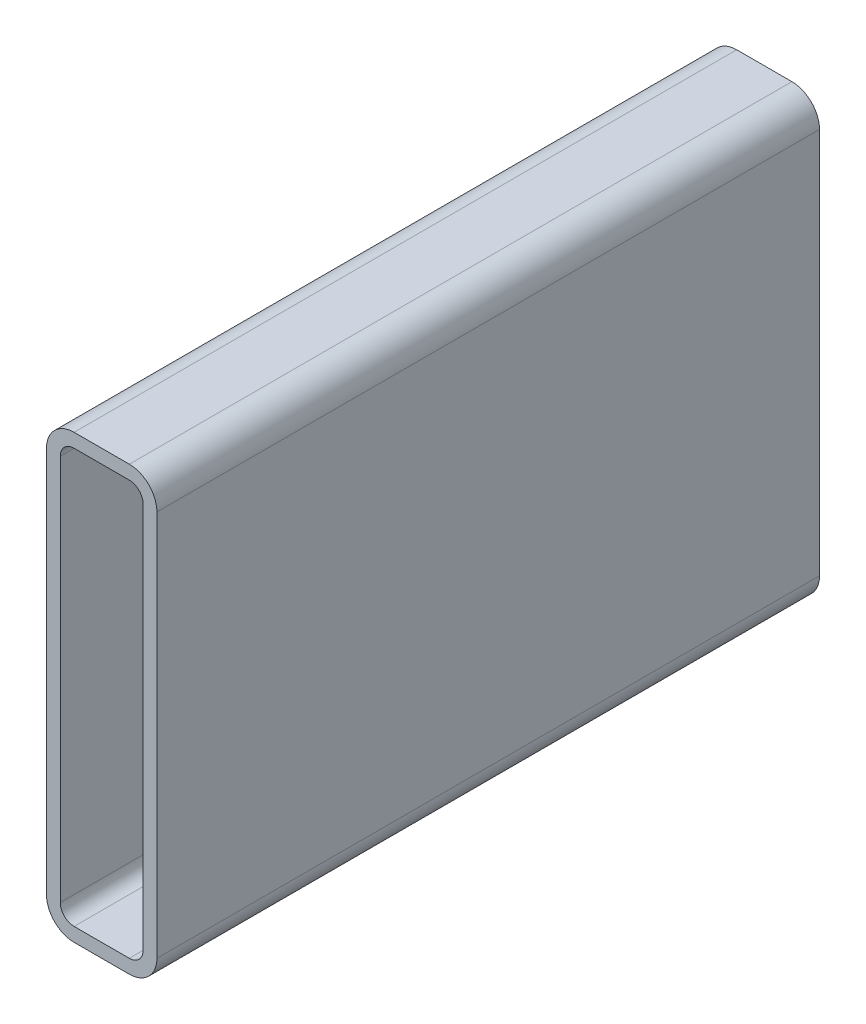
ISO-10303-21;
HEADER;
FILE_DESCRIPTION(('STEP AP214'),'2;1');
FILE_NAME('part.step','',(''),(''),'','','');
FILE_SCHEMA(('AUTOMOTIVE_DESIGN { 1 0 10303 214 1 1 1 1 }'));
ENDSEC;
DATA;
#1=APPLICATION_CONTEXT('core data for automotive mechanical design processes');
#2=APPLICATION_PROTOCOL_DEFINITION('international standard','automotive_design',2000,#1);
#3=PRODUCT_CONTEXT('',#1,'mechanical');
#4=PRODUCT('Part','Part','',(#3));
#5=PRODUCT_RELATED_PRODUCT_CATEGORY('part','',(#4));
#6=PRODUCT_DEFINITION_FORMATION('','',#4);
#7=PRODUCT_DEFINITION_CONTEXT('part definition',#1,'design');
#8=PRODUCT_DEFINITION('design','',#6,#7);
#9=PRODUCT_DEFINITION_SHAPE('','',#8);
#10=(LENGTH_UNIT() NAMED_UNIT(*) SI_UNIT(.MILLI.,.METRE.));
#11=(NAMED_UNIT(*) PLANE_ANGLE_UNIT() SI_UNIT($,.RADIAN.));
#12=(NAMED_UNIT(*) SI_UNIT($,.STERADIAN.) SOLID_ANGLE_UNIT());
#13=UNCERTAINTY_MEASURE_WITH_UNIT(LENGTH_MEASURE(1.E-05),#10,'distance_accuracy_value','');
#14=(GEOMETRIC_REPRESENTATION_CONTEXT(3) GLOBAL_UNCERTAINTY_ASSIGNED_CONTEXT((#13)) GLOBAL_UNIT_ASSIGNED_CONTEXT((#10,
#11,#12)) REPRESENTATION_CONTEXT('',''));
#15=CARTESIAN_POINT('',(0.,0.,0.));
#16=DIRECTION('',(0.,0.,1.));
#17=DIRECTION('',(1.,0.,0.));
#18=AXIS2_PLACEMENT_3D('',#15,#16,#17);
#19=CARTESIAN_POINT('',(12.7,190.5,304.8));
#20=DIRECTION('',(0.,0.,1.));
#21=DIRECTION('',(1.,0.,0.));
#22=AXIS2_PLACEMENT_3D('',#19,#20,#21);
#23=PLANE('',#22);
#24=CARTESIAN_POINT('',(12.7,190.5,304.8));
#25=DIRECTION('',(0.,0.,1.));
#26=DIRECTION('',(1.,0.,0.));
#27=AXIS2_PLACEMENT_3D('',#24,#25,#26);
#28=CIRCLE('',#27,12.7);
#29=CARTESIAN_POINT('',(12.7,203.2,304.8));
#30=VERTEX_POINT('',#29);
#31=CARTESIAN_POINT('',(0.,190.5,304.8));
#32=VERTEX_POINT('',#31);
#33=EDGE_CURVE('E211',#30,#32,#28,.T.);
#34=ORIENTED_EDGE('',*,*,#33,.T.);
#35=DIRECTION('',(0.,-1.,0.));
#36=VECTOR('',#35,1.);
#37=CARTESIAN_POINT('',(0.,12.7,304.8));
#38=LINE('',#37,#36);
#39=CARTESIAN_POINT('',(0.,12.7,304.8));
#40=VERTEX_POINT('',#39);
#41=EDGE_CURVE('E214',#32,#40,#38,.T.);
#42=ORIENTED_EDGE('',*,*,#41,.T.);
#43=CARTESIAN_POINT('',(12.7,12.7,304.8));
#44=DIRECTION('',(0.,0.,1.));
#45=DIRECTION('',(1.,0.,0.));
#46=AXIS2_PLACEMENT_3D('',#43,#44,#45);
#47=CIRCLE('',#46,12.7);
#48=CARTESIAN_POINT('',(12.7,0.,304.8));
#49=VERTEX_POINT('',#48);
#50=EDGE_CURVE('E217',#40,#49,#47,.T.);
#51=ORIENTED_EDGE('',*,*,#50,.T.);
#52=DIRECTION('',(1.,0.,0.));
#53=VECTOR('',#52,1.);
#54=CARTESIAN_POINT('',(38.1,0.,304.8));
#55=LINE('',#54,#53);
#56=CARTESIAN_POINT('',(38.1,0.,304.8));
#57=VERTEX_POINT('',#56);
#58=EDGE_CURVE('E219',#49,#57,#55,.T.);
#59=ORIENTED_EDGE('',*,*,#58,.T.);
#60=CARTESIAN_POINT('',(38.1,12.7,304.8));
#61=DIRECTION('',(0.,0.,1.));
#62=DIRECTION('',(1.,0.,0.));
#63=AXIS2_PLACEMENT_3D('',#60,#61,#62);
#64=CIRCLE('',#63,12.7);
#65=CARTESIAN_POINT('',(50.8,12.7,304.8));
#66=VERTEX_POINT('',#65);
#67=EDGE_CURVE('E221',#57,#66,#64,.T.);
#68=ORIENTED_EDGE('',*,*,#67,.T.);
#69=DIRECTION('',(0.,1.,0.));
#70=VECTOR('',#69,1.);
#71=CARTESIAN_POINT('',(50.8,190.5,304.8));
#72=LINE('',#71,#70);
#73=CARTESIAN_POINT('',(50.8,190.5,304.8));
#74=VERTEX_POINT('',#73);
#75=EDGE_CURVE('E223',#66,#74,#72,.T.);
#76=ORIENTED_EDGE('',*,*,#75,.T.);
#77=CARTESIAN_POINT('',(38.1,190.5,304.8));
#78=DIRECTION('',(0.,0.,1.));
#79=DIRECTION('',(1.,0.,0.));
#80=AXIS2_PLACEMENT_3D('',#77,#78,#79);
#81=CIRCLE('',#80,12.7);
#82=CARTESIAN_POINT('',(38.1,203.2,304.8));
#83=VERTEX_POINT('',#82);
#84=EDGE_CURVE('E225',#74,#83,#81,.T.);
#85=ORIENTED_EDGE('',*,*,#84,.T.);
#86=DIRECTION('',(-1.,0.,0.));
#87=VECTOR('',#86,1.);
#88=CARTESIAN_POINT('',(12.7,203.2,304.8));
#89=LINE('',#88,#87);
#90=EDGE_CURVE('E227',#83,#30,#89,.T.);
#91=ORIENTED_EDGE('',*,*,#90,.T.);
#92=EDGE_LOOP('',(#34,#42,#51,#59,#68,#76,#85,#91));
#93=FACE_BOUND('',#92,.T.);
#94=DIRECTION('',(0.,-1.,0.));
#95=VECTOR('',#94,1.);
#96=CARTESIAN_POINT('',(6.35,12.7,304.8));
#97=LINE('',#96,#95);
#98=CARTESIAN_POINT('',(6.35,190.5,304.8));
#99=VERTEX_POINT('',#98);
#100=CARTESIAN_POINT('',(6.35,12.7,304.8));
#101=VERTEX_POINT('',#100);
#102=EDGE_CURVE('E154',#99,#101,#97,.T.);
#103=ORIENTED_EDGE('',*,*,#102,.F.);
#104=CARTESIAN_POINT('',(12.7,190.5,304.8));
#105=DIRECTION('',(0.,0.,1.));
#106=DIRECTION('',(1.,0.,0.));
#107=AXIS2_PLACEMENT_3D('',#104,#105,#106);
#108=CIRCLE('',#107,6.35000000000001);
#109=CARTESIAN_POINT('',(12.7,196.85,304.8));
#110=VERTEX_POINT('',#109);
#111=EDGE_CURVE('E146',#110,#99,#108,.T.);
#112=ORIENTED_EDGE('',*,*,#111,.F.);
#113=DIRECTION('',(-1.,0.,0.));
#114=VECTOR('',#113,1.);
#115=CARTESIAN_POINT('',(12.7,196.85,304.8));
#116=LINE('',#115,#114);
#117=CARTESIAN_POINT('',(38.1,196.85,304.8));
#118=VERTEX_POINT('',#117);
#119=EDGE_CURVE('E179',#118,#110,#116,.T.);
#120=ORIENTED_EDGE('',*,*,#119,.F.);
#121=CARTESIAN_POINT('',(38.1,190.5,304.8));
#122=DIRECTION('',(0.,0.,1.));
#123=DIRECTION('',(1.,0.,0.));
#124=AXIS2_PLACEMENT_3D('',#121,#122,#123);
#125=CIRCLE('',#124,6.35000000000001);
#126=CARTESIAN_POINT('',(44.45,190.5,304.8));
#127=VERTEX_POINT('',#126);
#128=EDGE_CURVE('E177',#127,#118,#125,.T.);
#129=ORIENTED_EDGE('',*,*,#128,.F.);
#130=DIRECTION('',(0.,1.,0.));
#131=VECTOR('',#130,1.);
#132=CARTESIAN_POINT('',(44.45,190.5,304.8));
#133=LINE('',#132,#131);
#134=CARTESIAN_POINT('',(44.45,12.7,304.8));
#135=VERTEX_POINT('',#134);
#136=EDGE_CURVE('E175',#135,#127,#133,.T.);
#137=ORIENTED_EDGE('',*,*,#136,.F.);
#138=CARTESIAN_POINT('',(38.1,12.7,304.8));
#139=DIRECTION('',(0.,0.,1.));
#140=DIRECTION('',(1.,0.,0.));
#141=AXIS2_PLACEMENT_3D('',#138,#139,#140);
#142=CIRCLE('',#141,6.35);
#143=CARTESIAN_POINT('',(38.1,6.35,304.8));
#144=VERTEX_POINT('',#143);
#145=EDGE_CURVE('E173',#144,#135,#142,.T.);
#146=ORIENTED_EDGE('',*,*,#145,.F.);
#147=DIRECTION('',(1.,0.,0.));
#148=VECTOR('',#147,1.);
#149=CARTESIAN_POINT('',(38.1,6.35,304.8));
#150=LINE('',#149,#148);
#151=CARTESIAN_POINT('',(12.7,6.35,304.8));
#152=VERTEX_POINT('',#151);
#153=EDGE_CURVE('E169',#152,#144,#150,.T.);
#154=ORIENTED_EDGE('',*,*,#153,.F.);
#155=CARTESIAN_POINT('',(12.7,12.7,304.8));
#156=DIRECTION('',(0.,0.,1.));
#157=DIRECTION('',(1.,0.,0.));
#158=AXIS2_PLACEMENT_3D('',#155,#156,#157);
#159=CIRCLE('',#158,6.35);
#160=EDGE_CURVE('E167',#101,#152,#159,.T.);
#161=ORIENTED_EDGE('',*,*,#160,.F.);
#162=EDGE_LOOP('',(#103,#112,#120,#129,#137,#146,#154,#161));
#163=FACE_BOUND('',#162,.T.);
#164=ADVANCED_FACE('F33',(#93,#163),#23,.T.);
#165=CARTESIAN_POINT('',(12.7,190.5,0.));
#166=DIRECTION('',(0.,0.,1.));
#167=DIRECTION('',(1.,0.,0.));
#168=AXIS2_PLACEMENT_3D('',#165,#166,#167);
#169=PLANE('',#168);
#170=CARTESIAN_POINT('',(12.7,190.5,0.));
#171=DIRECTION('',(0.,0.,1.));
#172=DIRECTION('',(1.,0.,0.));
#173=AXIS2_PLACEMENT_3D('',#170,#171,#172);
#174=CIRCLE('',#173,12.7);
#175=CARTESIAN_POINT('',(12.7,203.2,0.));
#176=VERTEX_POINT('',#175);
#177=CARTESIAN_POINT('',(0.,190.5,0.));
#178=VERTEX_POINT('',#177);
#179=EDGE_CURVE('E162',#176,#178,#174,.T.);
#180=ORIENTED_EDGE('',*,*,#179,.F.);
#181=DIRECTION('',(-1.,0.,0.));
#182=VECTOR('',#181,1.);
#183=CARTESIAN_POINT('',(12.7,203.2,0.));
#184=LINE('',#183,#182);
#185=CARTESIAN_POINT('',(38.1,203.2,0.));
#186=VERTEX_POINT('',#185);
#187=EDGE_CURVE('E215',#186,#176,#184,.T.);
#188=ORIENTED_EDGE('',*,*,#187,.F.);
#189=CARTESIAN_POINT('',(38.1,190.5,0.));
#190=DIRECTION('',(0.,0.,1.));
#191=DIRECTION('',(1.,0.,0.));
#192=AXIS2_PLACEMENT_3D('',#189,#190,#191);
#193=CIRCLE('',#192,12.7);
#194=CARTESIAN_POINT('',(50.8,190.5,0.));
#195=VERTEX_POINT('',#194);
#196=EDGE_CURVE('E242',#195,#186,#193,.T.);
#197=ORIENTED_EDGE('',*,*,#196,.F.);
#198=DIRECTION('',(0.,1.,0.));
#199=VECTOR('',#198,1.);
#200=CARTESIAN_POINT('',(50.8,190.5,0.));
#201=LINE('',#200,#199);
#202=CARTESIAN_POINT('',(50.8,12.7,0.));
#203=VERTEX_POINT('',#202);
#204=EDGE_CURVE('E240',#203,#195,#201,.T.);
#205=ORIENTED_EDGE('',*,*,#204,.F.);
#206=CARTESIAN_POINT('',(38.1,12.7,0.));
#207=DIRECTION('',(0.,0.,1.));
#208=DIRECTION('',(1.,0.,0.));
#209=AXIS2_PLACEMENT_3D('',#206,#207,#208);
#210=CIRCLE('',#209,12.7);
#211=CARTESIAN_POINT('',(38.1,0.,0.));
#212=VERTEX_POINT('',#211);
#213=EDGE_CURVE('E238',#212,#203,#210,.T.);
#214=ORIENTED_EDGE('',*,*,#213,.F.);
#215=DIRECTION('',(1.,0.,0.));
#216=VECTOR('',#215,1.);
#217=CARTESIAN_POINT('',(38.1,0.,0.));
#218=LINE('',#217,#216);
#219=CARTESIAN_POINT('',(12.7,0.,0.));
#220=VERTEX_POINT('',#219);
#221=EDGE_CURVE('E236',#220,#212,#218,.T.);
#222=ORIENTED_EDGE('',*,*,#221,.F.);
#223=CARTESIAN_POINT('',(12.7,12.7,0.));
#224=DIRECTION('',(0.,0.,1.));
#225=DIRECTION('',(1.,0.,0.));
#226=AXIS2_PLACEMENT_3D('',#223,#224,#225);
#227=CIRCLE('',#226,12.7);
#228=CARTESIAN_POINT('',(0.,12.7,0.));
#229=VERTEX_POINT('',#228);
#230=EDGE_CURVE('E234',#229,#220,#227,.T.);
#231=ORIENTED_EDGE('',*,*,#230,.F.);
#232=DIRECTION('',(0.,-1.,0.));
#233=VECTOR('',#232,1.);
#234=CARTESIAN_POINT('',(0.,12.7,0.));
#235=LINE('',#234,#233);
#236=EDGE_CURVE('E232',#178,#229,#235,.T.);
#237=ORIENTED_EDGE('',*,*,#236,.F.);
#238=EDGE_LOOP('',(#180,#188,#197,#205,#214,#222,#231,#237));
#239=FACE_BOUND('',#238,.T.);
#240=CARTESIAN_POINT('',(12.7,190.5,0.));
#241=DIRECTION('',(0.,0.,1.));
#242=DIRECTION('',(1.,0.,0.));
#243=AXIS2_PLACEMENT_3D('',#240,#241,#242);
#244=CIRCLE('',#243,6.35000000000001);
#245=CARTESIAN_POINT('',(12.7,196.85,0.));
#246=VERTEX_POINT('',#245);
#247=CARTESIAN_POINT('',(6.35,190.5,0.));
#248=VERTEX_POINT('',#247);
#249=EDGE_CURVE('E56',#246,#248,#244,.T.);
#250=ORIENTED_EDGE('',*,*,#249,.T.);
#251=DIRECTION('',(0.,-1.,0.));
#252=VECTOR('',#251,1.);
#253=CARTESIAN_POINT('',(6.35,12.7,0.));
#254=LINE('',#253,#252);
#255=CARTESIAN_POINT('',(6.35,12.7,0.));
#256=VERTEX_POINT('',#255);
#257=EDGE_CURVE('E161',#248,#256,#254,.T.);
#258=ORIENTED_EDGE('',*,*,#257,.T.);
#259=CARTESIAN_POINT('',(12.7,12.7,0.));
#260=DIRECTION('',(0.,0.,1.));
#261=DIRECTION('',(1.,0.,0.));
#262=AXIS2_PLACEMENT_3D('',#259,#260,#261);
#263=CIRCLE('',#262,6.35);
#264=CARTESIAN_POINT('',(12.7,6.35,0.));
#265=VERTEX_POINT('',#264);
#266=EDGE_CURVE('E183',#256,#265,#263,.T.);
#267=ORIENTED_EDGE('',*,*,#266,.T.);
#268=DIRECTION('',(1.,0.,0.));
#269=VECTOR('',#268,1.);
#270=CARTESIAN_POINT('',(38.1,6.35,0.));
#271=LINE('',#270,#269);
#272=CARTESIAN_POINT('',(38.1,6.35,0.));
#273=VERTEX_POINT('',#272);
#274=EDGE_CURVE('E186',#265,#273,#271,.T.);
#275=ORIENTED_EDGE('',*,*,#274,.T.);
#276=CARTESIAN_POINT('',(38.1,12.7,0.));
#277=DIRECTION('',(0.,0.,1.));
#278=DIRECTION('',(1.,0.,0.));
#279=AXIS2_PLACEMENT_3D('',#276,#277,#278);
#280=CIRCLE('',#279,6.35);
#281=CARTESIAN_POINT('',(44.45,12.7,0.));
#282=VERTEX_POINT('',#281);
#283=EDGE_CURVE('E189',#273,#282,#280,.T.);
#284=ORIENTED_EDGE('',*,*,#283,.T.);
#285=DIRECTION('',(0.,1.,0.));
#286=VECTOR('',#285,1.);
#287=CARTESIAN_POINT('',(44.45,190.5,0.));
#288=LINE('',#287,#286);
#289=CARTESIAN_POINT('',(44.45,190.5,0.));
#290=VERTEX_POINT('',#289);
#291=EDGE_CURVE('E192',#282,#290,#288,.T.);
#292=ORIENTED_EDGE('',*,*,#291,.T.);
#293=CARTESIAN_POINT('',(38.1,190.5,0.));
#294=DIRECTION('',(0.,0.,1.));
#295=DIRECTION('',(1.,0.,0.));
#296=AXIS2_PLACEMENT_3D('',#293,#294,#295);
#297=CIRCLE('',#296,6.35000000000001);
#298=CARTESIAN_POINT('',(38.1,196.85,0.));
#299=VERTEX_POINT('',#298);
#300=EDGE_CURVE('E195',#290,#299,#297,.T.);
#301=ORIENTED_EDGE('',*,*,#300,.T.);
#302=DIRECTION('',(-1.,0.,0.));
#303=VECTOR('',#302,1.);
#304=CARTESIAN_POINT('',(12.7,196.85,0.));
#305=LINE('',#304,#303);
#306=EDGE_CURVE('E155',#299,#246,#305,.T.);
#307=ORIENTED_EDGE('',*,*,#306,.T.);
#308=EDGE_LOOP('',(#250,#258,#267,#275,#284,#292,#301,#307));
#309=FACE_BOUND('',#308,.T.);
#310=ADVANCED_FACE('F272',(#239,#309),#169,.F.);
#311=CARTESIAN_POINT('',(12.7,190.5,304.8));
#312=DIRECTION('',(0.,0.,-1.));
#313=DIRECTION('',(-1.,0.,0.));
#314=AXIS2_PLACEMENT_3D('',#311,#312,#313);
#315=CYLINDRICAL_SURFACE('',#314,12.7);
#316=ORIENTED_EDGE('',*,*,#179,.T.);
#317=DIRECTION('',(0.,0.,-1.));
#318=VECTOR('',#317,1.);
#319=CARTESIAN_POINT('',(0.,190.5,304.8));
#320=LINE('',#319,#318);
#321=EDGE_CURVE('E11',#32,#178,#320,.T.);
#322=ORIENTED_EDGE('',*,*,#321,.F.);
#323=ORIENTED_EDGE('',*,*,#33,.F.);
#324=DIRECTION('',(0.,0.,-1.));
#325=VECTOR('',#324,1.);
#326=CARTESIAN_POINT('',(12.7,203.2,304.8));
#327=LINE('',#326,#325);
#328=EDGE_CURVE('E229',#30,#176,#327,.T.);
#329=ORIENTED_EDGE('',*,*,#328,.T.);
#330=EDGE_LOOP('',(#316,#322,#323,#329));
#331=FACE_BOUND('',#330,.T.);
#332=ADVANCED_FACE('F35',(#331),#315,.T.);
#333=CARTESIAN_POINT('',(0.,12.7,304.8));
#334=DIRECTION('',(1.,0.,0.));
#335=DIRECTION('',(0.,0.,-1.));
#336=AXIS2_PLACEMENT_3D('',#333,#334,#335);
#337=PLANE('',#336);
#338=ORIENTED_EDGE('',*,*,#236,.T.);
#339=DIRECTION('',(0.,0.,-1.));
#340=VECTOR('',#339,1.);
#341=CARTESIAN_POINT('',(0.,12.7,304.8));
#342=LINE('',#341,#340);
#343=EDGE_CURVE('E41',#40,#229,#342,.T.);
#344=ORIENTED_EDGE('',*,*,#343,.F.);
#345=ORIENTED_EDGE('',*,*,#41,.F.);
#346=ORIENTED_EDGE('',*,*,#321,.T.);
#347=EDGE_LOOP('',(#338,#344,#345,#346));
#348=FACE_BOUND('',#347,.T.);
#349=ADVANCED_FACE('F289',(#348),#337,.F.);
#350=CARTESIAN_POINT('',(12.7,12.7,304.8));
#351=DIRECTION('',(0.,0.,-1.));
#352=DIRECTION('',(-1.,0.,0.));
#353=AXIS2_PLACEMENT_3D('',#350,#351,#352);
#354=CYLINDRICAL_SURFACE('',#353,12.7);
#355=ORIENTED_EDGE('',*,*,#230,.T.);
#356=DIRECTION('',(0.,0.,-1.));
#357=VECTOR('',#356,1.);
#358=CARTESIAN_POINT('',(12.7,0.,304.8));
#359=LINE('',#358,#357);
#360=EDGE_CURVE('E259',#49,#220,#359,.T.);
#361=ORIENTED_EDGE('',*,*,#360,.F.);
#362=ORIENTED_EDGE('',*,*,#50,.F.);
#363=ORIENTED_EDGE('',*,*,#343,.T.);
#364=EDGE_LOOP('',(#355,#361,#362,#363));
#365=FACE_BOUND('',#364,.T.);
#366=ADVANCED_FACE('F266',(#365),#354,.T.);
#367=CARTESIAN_POINT('',(38.1,0.,304.8));
#368=DIRECTION('',(0.,1.,0.));
#369=DIRECTION('',(0.,0.,1.));
#370=AXIS2_PLACEMENT_3D('',#367,#368,#369);
#371=PLANE('',#370);
#372=ORIENTED_EDGE('',*,*,#221,.T.);
#373=DIRECTION('',(0.,0.,-1.));
#374=VECTOR('',#373,1.);
#375=CARTESIAN_POINT('',(38.1,0.,304.8));
#376=LINE('',#375,#374);
#377=EDGE_CURVE('E256',#57,#212,#376,.T.);
#378=ORIENTED_EDGE('',*,*,#377,.F.);
#379=ORIENTED_EDGE('',*,*,#58,.F.);
#380=ORIENTED_EDGE('',*,*,#360,.T.);
#381=EDGE_LOOP('',(#372,#378,#379,#380));
#382=FACE_BOUND('',#381,.T.);
#383=ADVANCED_FACE('F278',(#382),#371,.F.);
#384=CARTESIAN_POINT('',(38.1,12.7,304.8));
#385=DIRECTION('',(0.,0.,-1.));
#386=DIRECTION('',(-1.,0.,0.));
#387=AXIS2_PLACEMENT_3D('',#384,#385,#386);
#388=CYLINDRICAL_SURFACE('',#387,12.7);
#389=ORIENTED_EDGE('',*,*,#213,.T.);
#390=DIRECTION('',(0.,0.,-1.));
#391=VECTOR('',#390,1.);
#392=CARTESIAN_POINT('',(50.8,12.7,304.8));
#393=LINE('',#392,#391);
#394=EDGE_CURVE('E253',#66,#203,#393,.T.);
#395=ORIENTED_EDGE('',*,*,#394,.F.);
#396=ORIENTED_EDGE('',*,*,#67,.F.);
#397=ORIENTED_EDGE('',*,*,#377,.T.);
#398=EDGE_LOOP('',(#389,#395,#396,#397));
#399=FACE_BOUND('',#398,.T.);
#400=ADVANCED_FACE('F282',(#399),#388,.T.);
#401=CARTESIAN_POINT('',(50.8,190.5,304.8));
#402=DIRECTION('',(-1.,0.,0.));
#403=DIRECTION('',(0.,0.,1.));
#404=AXIS2_PLACEMENT_3D('',#401,#402,#403);
#405=PLANE('',#404);
#406=ORIENTED_EDGE('',*,*,#204,.T.);
#407=DIRECTION('',(0.,0.,-1.));
#408=VECTOR('',#407,1.);
#409=CARTESIAN_POINT('',(50.8,190.5,304.8));
#410=LINE('',#409,#408);
#411=EDGE_CURVE('E250',#74,#195,#410,.T.);
#412=ORIENTED_EDGE('',*,*,#411,.F.);
#413=ORIENTED_EDGE('',*,*,#75,.F.);
#414=ORIENTED_EDGE('',*,*,#394,.T.);
#415=EDGE_LOOP('',(#406,#412,#413,#414));
#416=FACE_BOUND('',#415,.T.);
#417=ADVANCED_FACE('F302',(#416),#405,.F.);
#418=CARTESIAN_POINT('',(38.1,190.5,304.8));
#419=DIRECTION('',(0.,0.,-1.));
#420=DIRECTION('',(-1.,0.,0.));
#421=AXIS2_PLACEMENT_3D('',#418,#419,#420);
#422=CYLINDRICAL_SURFACE('',#421,12.7);
#423=ORIENTED_EDGE('',*,*,#196,.T.);
#424=DIRECTION('',(0.,0.,-1.));
#425=VECTOR('',#424,1.);
#426=CARTESIAN_POINT('',(38.1,203.2,304.8));
#427=LINE('',#426,#425);
#428=EDGE_CURVE('E247',#83,#186,#427,.T.);
#429=ORIENTED_EDGE('',*,*,#428,.F.);
#430=ORIENTED_EDGE('',*,*,#84,.F.);
#431=ORIENTED_EDGE('',*,*,#411,.T.);
#432=EDGE_LOOP('',(#423,#429,#430,#431));
#433=FACE_BOUND('',#432,.T.);
#434=ADVANCED_FACE('F300',(#433),#422,.T.);
#435=CARTESIAN_POINT('',(12.7,203.2,304.8));
#436=DIRECTION('',(0.,-1.,0.));
#437=DIRECTION('',(0.,0.,-1.));
#438=AXIS2_PLACEMENT_3D('',#435,#436,#437);
#439=PLANE('',#438);
#440=ORIENTED_EDGE('',*,*,#187,.T.);
#441=ORIENTED_EDGE('',*,*,#328,.F.);
#442=ORIENTED_EDGE('',*,*,#90,.F.);
#443=ORIENTED_EDGE('',*,*,#428,.T.);
#444=EDGE_LOOP('',(#440,#441,#442,#443));
#445=FACE_BOUND('',#444,.T.);
#446=ADVANCED_FACE('F295',(#445),#439,.F.);
#447=CARTESIAN_POINT('',(12.7,190.5,304.8));
#448=DIRECTION('',(0.,0.,-1.));
#449=DIRECTION('',(-1.,0.,0.));
#450=AXIS2_PLACEMENT_3D('',#447,#448,#449);
#451=CYLINDRICAL_SURFACE('',#450,6.35000000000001);
#452=ORIENTED_EDGE('',*,*,#249,.F.);
#453=DIRECTION('',(0.,0.,-1.));
#454=VECTOR('',#453,1.);
#455=CARTESIAN_POINT('',(12.7,196.85,304.8));
#456=LINE('',#455,#454);
#457=EDGE_CURVE('E150',#110,#246,#456,.T.);
#458=ORIENTED_EDGE('',*,*,#457,.F.);
#459=ORIENTED_EDGE('',*,*,#111,.T.);
#460=DIRECTION('',(0.,0.,-1.));
#461=VECTOR('',#460,1.);
#462=CARTESIAN_POINT('',(6.35,190.5,304.8));
#463=LINE('',#462,#461);
#464=EDGE_CURVE('E149',#99,#248,#463,.T.);
#465=ORIENTED_EDGE('',*,*,#464,.T.);
#466=EDGE_LOOP('',(#452,#458,#459,#465));
#467=FACE_BOUND('',#466,.T.);
#468=ADVANCED_FACE('F148',(#467),#451,.F.);
#469=CARTESIAN_POINT('',(6.35,12.7,304.8));
#470=DIRECTION('',(1.,0.,0.));
#471=DIRECTION('',(0.,0.,-1.));
#472=AXIS2_PLACEMENT_3D('',#469,#470,#471);
#473=PLANE('',#472);
#474=ORIENTED_EDGE('',*,*,#257,.F.);
#475=ORIENTED_EDGE('',*,*,#464,.F.);
#476=ORIENTED_EDGE('',*,*,#102,.T.);
#477=DIRECTION('',(0.,0.,-1.));
#478=VECTOR('',#477,1.);
#479=CARTESIAN_POINT('',(6.35,12.7,304.8));
#480=LINE('',#479,#478);
#481=EDGE_CURVE('E163',#101,#256,#480,.T.);
#482=ORIENTED_EDGE('',*,*,#481,.T.);
#483=EDGE_LOOP('',(#474,#475,#476,#482));
#484=FACE_BOUND('',#483,.T.);
#485=ADVANCED_FACE('F158',(#484),#473,.T.);
#486=CARTESIAN_POINT('',(12.7,12.7,304.8));
#487=DIRECTION('',(0.,0.,-1.));
#488=DIRECTION('',(-1.,0.,0.));
#489=AXIS2_PLACEMENT_3D('',#486,#487,#488);
#490=CYLINDRICAL_SURFACE('',#489,6.35);
#491=ORIENTED_EDGE('',*,*,#266,.F.);
#492=ORIENTED_EDGE('',*,*,#481,.F.);
#493=ORIENTED_EDGE('',*,*,#160,.T.);
#494=DIRECTION('',(0.,0.,-1.));
#495=VECTOR('',#494,1.);
#496=CARTESIAN_POINT('',(12.7,6.35,304.8));
#497=LINE('',#496,#495);
#498=EDGE_CURVE('E208',#152,#265,#497,.T.);
#499=ORIENTED_EDGE('',*,*,#498,.T.);
#500=EDGE_LOOP('',(#491,#492,#493,#499));
#501=FACE_BOUND('',#500,.T.);
#502=ADVANCED_FACE('F327',(#501),#490,.F.);
#503=CARTESIAN_POINT('',(38.1,6.35,304.8));
#504=DIRECTION('',(0.,1.,0.));
#505=DIRECTION('',(0.,0.,1.));
#506=AXIS2_PLACEMENT_3D('',#503,#504,#505);
#507=PLANE('',#506);
#508=ORIENTED_EDGE('',*,*,#274,.F.);
#509=ORIENTED_EDGE('',*,*,#498,.F.);
#510=ORIENTED_EDGE('',*,*,#153,.T.);
#511=DIRECTION('',(0.,0.,-1.));
#512=VECTOR('',#511,1.);
#513=CARTESIAN_POINT('',(38.1,6.35,304.8));
#514=LINE('',#513,#512);
#515=EDGE_CURVE('E206',#144,#273,#514,.T.);
#516=ORIENTED_EDGE('',*,*,#515,.T.);
#517=EDGE_LOOP('',(#508,#509,#510,#516));
#518=FACE_BOUND('',#517,.T.);
#519=ADVANCED_FACE('F331',(#518),#507,.T.);
#520=CARTESIAN_POINT('',(38.1,12.7,304.8));
#521=DIRECTION('',(0.,0.,-1.));
#522=DIRECTION('',(-1.,0.,0.));
#523=AXIS2_PLACEMENT_3D('',#520,#521,#522);
#524=CYLINDRICAL_SURFACE('',#523,6.35);
#525=ORIENTED_EDGE('',*,*,#283,.F.);
#526=ORIENTED_EDGE('',*,*,#515,.F.);
#527=ORIENTED_EDGE('',*,*,#145,.T.);
#528=DIRECTION('',(0.,0.,-1.));
#529=VECTOR('',#528,1.);
#530=CARTESIAN_POINT('',(44.45,12.7,304.8));
#531=LINE('',#530,#529);
#532=EDGE_CURVE('E204',#135,#282,#531,.T.);
#533=ORIENTED_EDGE('',*,*,#532,.T.);
#534=EDGE_LOOP('',(#525,#526,#527,#533));
#535=FACE_BOUND('',#534,.T.);
#536=ADVANCED_FACE('F337',(#535),#524,.F.);
#537=CARTESIAN_POINT('',(44.45,190.5,304.8));
#538=DIRECTION('',(-1.,0.,0.));
#539=DIRECTION('',(0.,0.,1.));
#540=AXIS2_PLACEMENT_3D('',#537,#538,#539);
#541=PLANE('',#540);
#542=ORIENTED_EDGE('',*,*,#291,.F.);
#543=ORIENTED_EDGE('',*,*,#532,.F.);
#544=ORIENTED_EDGE('',*,*,#136,.T.);
#545=DIRECTION('',(0.,0.,-1.));
#546=VECTOR('',#545,1.);
#547=CARTESIAN_POINT('',(44.45,190.5,304.8));
#548=LINE('',#547,#546);
#549=EDGE_CURVE('E202',#127,#290,#548,.T.);
#550=ORIENTED_EDGE('',*,*,#549,.T.);
#551=EDGE_LOOP('',(#542,#543,#544,#550));
#552=FACE_BOUND('',#551,.T.);
#553=ADVANCED_FACE('F341',(#552),#541,.T.);
#554=CARTESIAN_POINT('',(38.1,190.5,304.8));
#555=DIRECTION('',(0.,0.,-1.));
#556=DIRECTION('',(-1.,0.,0.));
#557=AXIS2_PLACEMENT_3D('',#554,#555,#556);
#558=CYLINDRICAL_SURFACE('',#557,6.35000000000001);
#559=ORIENTED_EDGE('',*,*,#300,.F.);
#560=ORIENTED_EDGE('',*,*,#549,.F.);
#561=ORIENTED_EDGE('',*,*,#128,.T.);
#562=DIRECTION('',(0.,0.,-1.));
#563=VECTOR('',#562,1.);
#564=CARTESIAN_POINT('',(38.1,196.85,304.8));
#565=LINE('',#564,#563);
#566=EDGE_CURVE('E48',#118,#299,#565,.T.);
#567=ORIENTED_EDGE('',*,*,#566,.T.);
#568=EDGE_LOOP('',(#559,#560,#561,#567));
#569=FACE_BOUND('',#568,.T.);
#570=ADVANCED_FACE('F345',(#569),#558,.F.);
#571=CARTESIAN_POINT('',(12.7,196.85,304.8));
#572=DIRECTION('',(0.,-1.,0.));
#573=DIRECTION('',(0.,0.,-1.));
#574=AXIS2_PLACEMENT_3D('',#571,#572,#573);
#575=PLANE('',#574);
#576=ORIENTED_EDGE('',*,*,#306,.F.);
#577=ORIENTED_EDGE('',*,*,#566,.F.);
#578=ORIENTED_EDGE('',*,*,#119,.T.);
#579=ORIENTED_EDGE('',*,*,#457,.T.);
#580=EDGE_LOOP('',(#576,#577,#578,#579));
#581=FACE_BOUND('',#580,.T.);
#582=ADVANCED_FACE('F349',(#581),#575,.T.);
#583=CLOSED_SHELL('',(#164,#310,#332,#349,#366,#383,#400,#417,#434,#446,#468,#485,#502,#519,
#536,#553,#570,#582));
#584=MANIFOLD_SOLID_BREP('B2',#583);
#585=ADVANCED_BREP_SHAPE_REPRESENTATION('',(#18,#584),#14);
#586=SHAPE_DEFINITION_REPRESENTATION(#9,#585);
ENDSEC;
END-ISO-10303-21;
